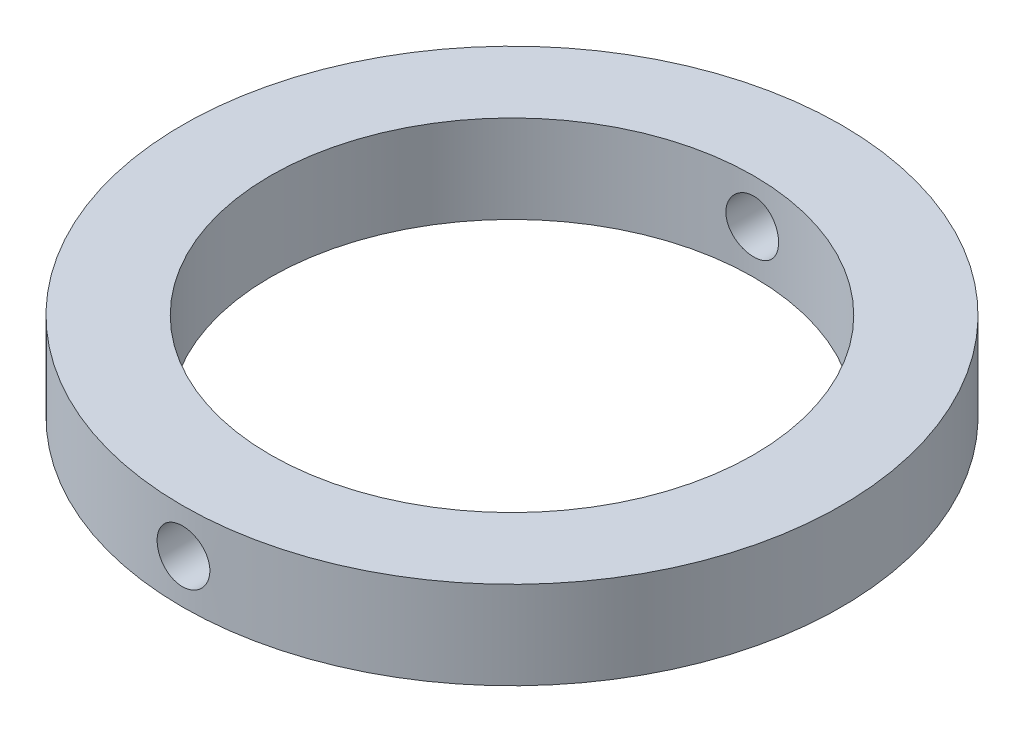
from build123d import *

# Parameters (mm, degrees)
SKETCH1_R           = 37.5
SKETCH1_R_2         = 27.5
BOSS_EXTRUDE1_DEPTH = 10
SKETCH2_R           = 3
CUT_EXTRUDE1_DEPTH  = 52.5


with BuildPart() as part:
    # Sketch1 → Boss-Extrude1 (new body)
    with BuildSketch(Plane(origin=(0, 0, 0), x_dir=(1, 0, 0), z_dir=(0, 1, 0))):
        with Locations(Location((0, 0, 0), (0, 0, 270))):
            Circle(SKETCH1_R)
        with Locations(Location((0, 0, 0), (0, 0, 270))):
            Circle(SKETCH1_R_2, mode=Mode.SUBTRACT)
    extrude(amount=BOSS_EXTRUDE1_DEPTH)

    # Sketch2 → Cut-Extrude1 (cut, symmetric)
    with BuildSketch(Plane.XY):
        with Locations((0, 5)):
            Circle(SKETCH2_R)
    extrude(amount=CUT_EXTRUDE1_DEPTH, both=True, mode=Mode.SUBTRACT)


solid = part.part
